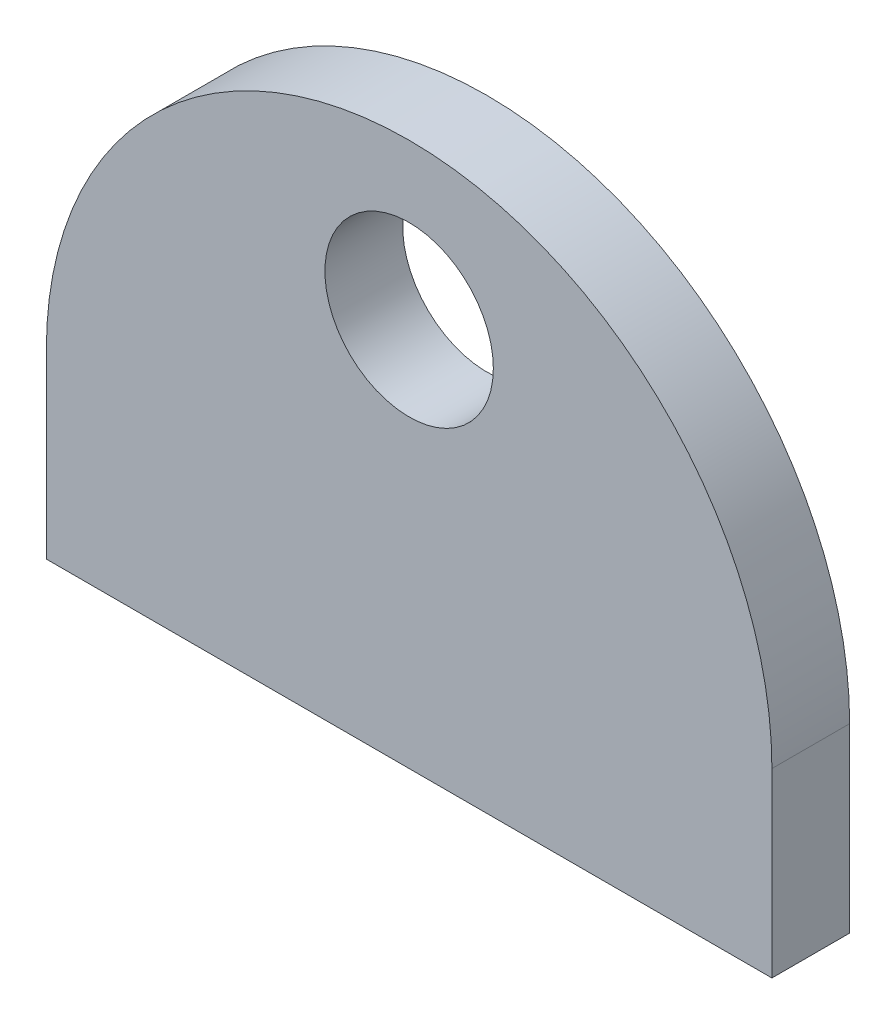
from build123d import *

# Parameters (mm, degrees)
ESQUISSE1_R          = 3.25
BASE_EXTRUSION_DEPTH = 3


with BuildPart() as part:
    # Esquisse1 → Base-Extrusion (new body)
    with BuildSketch(Plane.XY):
        with BuildLine():
            Line((14, -8), (14, -15))
            Line((14, -15), (-14, -15))
            Line((-14, -15), (-14, -8))
            ThreePointArc((-14, -8), (0, 6), (14, -8))
        make_face()
        Circle(ESQUISSE1_R, mode=Mode.SUBTRACT)
    extrude(amount=BASE_EXTRUSION_DEPTH)


solid = part.part
